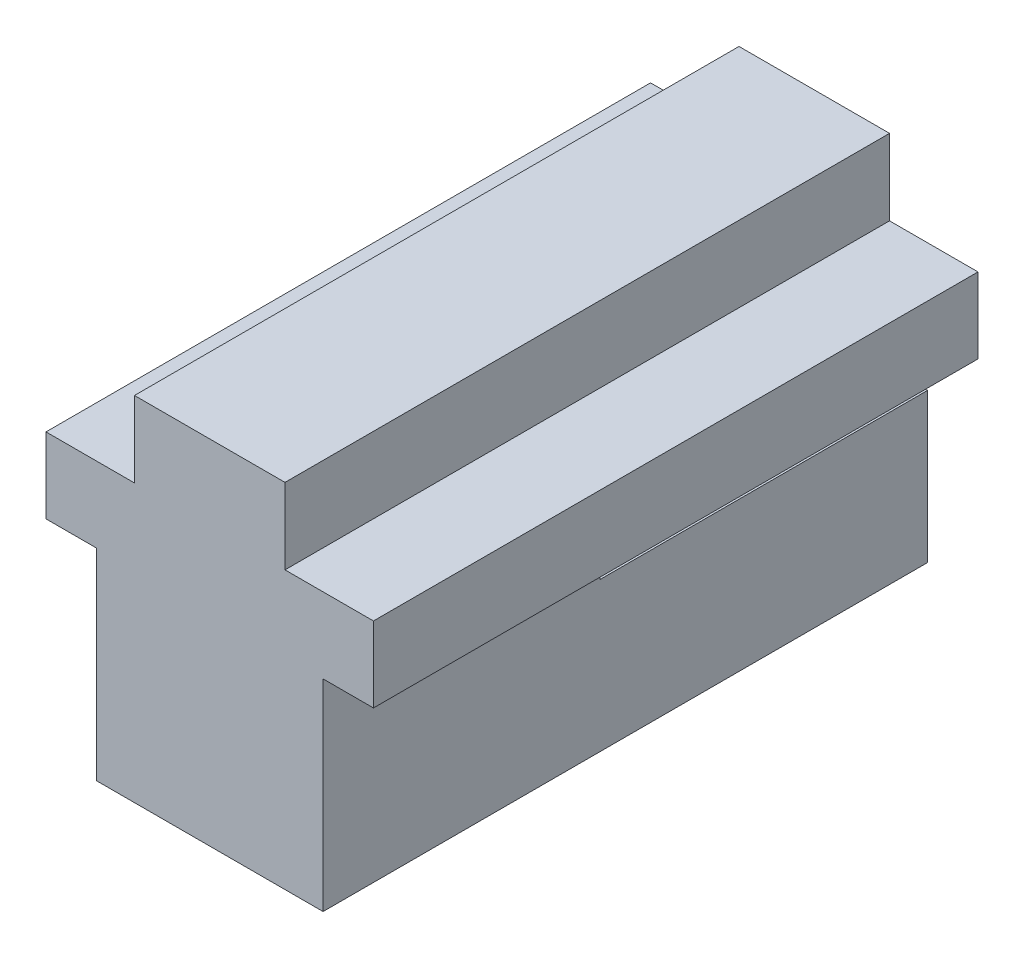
ISO-10303-21;
HEADER;
FILE_DESCRIPTION(('STEP AP214'),'2;1');
FILE_NAME('part.step','',(''),(''),'','','');
FILE_SCHEMA(('AUTOMOTIVE_DESIGN { 1 0 10303 214 1 1 1 1 }'));
ENDSEC;
DATA;
#1=APPLICATION_CONTEXT('core data for automotive mechanical design processes');
#2=APPLICATION_PROTOCOL_DEFINITION('international standard','automotive_design',2000,#1);
#3=PRODUCT_CONTEXT('',#1,'mechanical');
#4=PRODUCT('Part','Part','',(#3));
#5=PRODUCT_RELATED_PRODUCT_CATEGORY('part','',(#4));
#6=PRODUCT_DEFINITION_FORMATION('','',#4);
#7=PRODUCT_DEFINITION_CONTEXT('part definition',#1,'design');
#8=PRODUCT_DEFINITION('design','',#6,#7);
#9=PRODUCT_DEFINITION_SHAPE('','',#8);
#10=(LENGTH_UNIT() NAMED_UNIT(*) SI_UNIT(.MILLI.,.METRE.));
#11=(NAMED_UNIT(*) PLANE_ANGLE_UNIT() SI_UNIT($,.RADIAN.));
#12=(NAMED_UNIT(*) SI_UNIT($,.STERADIAN.) SOLID_ANGLE_UNIT());
#13=UNCERTAINTY_MEASURE_WITH_UNIT(LENGTH_MEASURE(1.E-05),#10,'distance_accuracy_value','');
#14=(GEOMETRIC_REPRESENTATION_CONTEXT(3) GLOBAL_UNCERTAINTY_ASSIGNED_CONTEXT((#13)) GLOBAL_UNIT_ASSIGNED_CONTEXT((#10,
#11,#12)) REPRESENTATION_CONTEXT('',''));
#15=CARTESIAN_POINT('',(0.,0.,0.));
#16=DIRECTION('',(0.,0.,1.));
#17=DIRECTION('',(1.,0.,0.));
#18=AXIS2_PLACEMENT_3D('',#15,#16,#17);
#19=CARTESIAN_POINT('',(0.,0.,-76.2));
#20=DIRECTION('',(0.,0.,-1.));
#21=DIRECTION('',(-1.,0.,0.));
#22=AXIS2_PLACEMENT_3D('',#19,#20,#21);
#23=PLANE('',#22);
#24=DIRECTION('',(0.,1.,0.));
#25=VECTOR('',#24,1.);
#26=CARTESIAN_POINT('',(38.2651,-3.1496,-76.2));
#27=LINE('',#26,#25);
#28=CARTESIAN_POINT('',(38.2651,-3.1496,-76.2));
#29=VERTEX_POINT('',#28);
#30=CARTESIAN_POINT('',(38.2651,6.35,-76.2));
#31=VERTEX_POINT('',#30);
#32=EDGE_CURVE('E260',#29,#31,#27,.T.);
#33=ORIENTED_EDGE('',*,*,#32,.F.);
#34=DIRECTION('',(1.,0.,0.));
#35=VECTOR('',#34,1.);
#36=CARTESIAN_POINT('',(-3.00990000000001,-3.1496,-76.2));
#37=LINE('',#36,#35);
#38=CARTESIAN_POINT('',(-3.00990000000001,-3.1496,-76.2));
#39=VERTEX_POINT('',#38);
#40=EDGE_CURVE('E278',#39,#29,#37,.T.);
#41=ORIENTED_EDGE('',*,*,#40,.F.);
#42=DIRECTION('',(0.,-1.,0.));
#43=VECTOR('',#42,1.);
#44=CARTESIAN_POINT('',(-3.00990000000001,-3.1496,-76.2));
#45=LINE('',#44,#43);
#46=CARTESIAN_POINT('',(-3.00990000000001,6.35,-76.2));
#47=VERTEX_POINT('',#46);
#48=EDGE_CURVE('E196',#47,#39,#45,.T.);
#49=ORIENTED_EDGE('',*,*,#48,.F.);
#50=DIRECTION('',(-1.,0.,0.));
#51=VECTOR('',#50,1.);
#52=CARTESIAN_POINT('',(-3.00990000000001,6.35,-76.2));
#53=LINE('',#52,#51);
#54=CARTESIAN_POINT('',(8.14069999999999,6.35,-76.2));
#55=VERTEX_POINT('',#54);
#56=EDGE_CURVE('E152',#55,#47,#53,.T.);
#57=ORIENTED_EDGE('',*,*,#56,.F.);
#58=DIRECTION('',(0.,-1.,0.));
#59=VECTOR('',#58,1.);
#60=CARTESIAN_POINT('',(8.14069999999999,6.35,-76.2));
#61=LINE('',#60,#59);
#62=CARTESIAN_POINT('',(8.14069999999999,15.9004,-76.2));
#63=VERTEX_POINT('',#62);
#64=EDGE_CURVE('E135',#63,#55,#61,.T.);
#65=ORIENTED_EDGE('',*,*,#64,.F.);
#66=DIRECTION('',(-1.,0.,0.));
#67=VECTOR('',#66,1.);
#68=CARTESIAN_POINT('',(8.14069999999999,15.9004,-76.2));
#69=LINE('',#68,#67);
#70=CARTESIAN_POINT('',(27.1145,15.9004,-76.2));
#71=VERTEX_POINT('',#70);
#72=EDGE_CURVE('E150',#71,#63,#69,.T.);
#73=ORIENTED_EDGE('',*,*,#72,.F.);
#74=DIRECTION('',(0.,1.,0.));
#75=VECTOR('',#74,1.);
#76=CARTESIAN_POINT('',(27.1145,6.35,-76.2));
#77=LINE('',#76,#75);
#78=CARTESIAN_POINT('',(27.1145,6.35,-76.2));
#79=VERTEX_POINT('',#78);
#80=EDGE_CURVE('E155',#79,#71,#77,.T.);
#81=ORIENTED_EDGE('',*,*,#80,.F.);
#82=DIRECTION('',(-1.,0.,0.));
#83=VECTOR('',#82,1.);
#84=CARTESIAN_POINT('',(27.1145,6.35,-76.2));
#85=LINE('',#84,#83);
#86=EDGE_CURVE('E157',#31,#79,#85,.T.);
#87=ORIENTED_EDGE('',*,*,#86,.F.);
#88=EDGE_LOOP('',(#33,#41,#49,#57,#65,#73,#81,#87));
#89=FACE_BOUND('',#88,.T.);
#90=ADVANCED_FACE('F35',(#89),#23,.T.);
#91=CARTESIAN_POINT('',(-3.00990000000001,-3.1496,-76.2));
#92=DIRECTION('',(-1.,0.,0.));
#93=DIRECTION('',(0.,0.,1.));
#94=AXIS2_PLACEMENT_3D('',#91,#92,#93);
#95=PLANE('',#94);
#96=DIRECTION('',(0.,-1.,0.));
#97=VECTOR('',#96,1.);
#98=CARTESIAN_POINT('',(-3.00990000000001,-3.1496,0.));
#99=LINE('',#98,#97);
#100=CARTESIAN_POINT('',(-3.00990000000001,6.35,0.));
#101=VERTEX_POINT('',#100);
#102=CARTESIAN_POINT('',(-3.00990000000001,-3.1496,0.));
#103=VERTEX_POINT('',#102);
#104=EDGE_CURVE('E162',#101,#103,#99,.T.);
#105=ORIENTED_EDGE('',*,*,#104,.F.);
#106=DIRECTION('',(0.,0.,1.));
#107=VECTOR('',#106,1.);
#108=CARTESIAN_POINT('',(-3.00990000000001,6.35,-76.2));
#109=LINE('',#108,#107);
#110=EDGE_CURVE('E43',#47,#101,#109,.T.);
#111=ORIENTED_EDGE('',*,*,#110,.F.);
#112=ORIENTED_EDGE('',*,*,#48,.T.);
#113=DIRECTION('',(0.,0.,1.));
#114=VECTOR('',#113,1.);
#115=CARTESIAN_POINT('',(-3.00990000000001,-3.1496,-76.2));
#116=LINE('',#115,#114);
#117=EDGE_CURVE('E108',#39,#103,#116,.T.);
#118=ORIENTED_EDGE('',*,*,#117,.T.);
#119=EDGE_LOOP('',(#105,#111,#112,#118));
#120=FACE_BOUND('',#119,.T.);
#121=ADVANCED_FACE('F37',(#120),#95,.T.);
#122=CARTESIAN_POINT('',(-3.00990000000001,6.35,-76.2));
#123=DIRECTION('',(0.,1.,0.));
#124=DIRECTION('',(0.,0.,1.));
#125=AXIS2_PLACEMENT_3D('',#122,#123,#124);
#126=PLANE('',#125);
#127=DIRECTION('',(-1.,0.,0.));
#128=VECTOR('',#127,1.);
#129=CARTESIAN_POINT('',(-3.00990000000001,6.35,0.));
#130=LINE('',#129,#128);
#131=CARTESIAN_POINT('',(8.14069999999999,6.35,0.));
#132=VERTEX_POINT('',#131);
#133=EDGE_CURVE('E193',#132,#101,#130,.T.);
#134=ORIENTED_EDGE('',*,*,#133,.F.);
#135=DIRECTION('',(0.,0.,1.));
#136=VECTOR('',#135,1.);
#137=CARTESIAN_POINT('',(8.14069999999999,6.35,-76.2));
#138=LINE('',#137,#136);
#139=EDGE_CURVE('E143',#55,#132,#138,.T.);
#140=ORIENTED_EDGE('',*,*,#139,.F.);
#141=ORIENTED_EDGE('',*,*,#56,.T.);
#142=ORIENTED_EDGE('',*,*,#110,.T.);
#143=EDGE_LOOP('',(#134,#140,#141,#142));
#144=FACE_BOUND('',#143,.T.);
#145=ADVANCED_FACE('F220',(#144),#126,.T.);
#146=CARTESIAN_POINT('',(8.14069999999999,6.35,-76.2));
#147=DIRECTION('',(-1.,0.,0.));
#148=DIRECTION('',(0.,0.,1.));
#149=AXIS2_PLACEMENT_3D('',#146,#147,#148);
#150=PLANE('',#149);
#151=DIRECTION('',(0.,-1.,0.));
#152=VECTOR('',#151,1.);
#153=CARTESIAN_POINT('',(8.14069999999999,6.35,0.));
#154=LINE('',#153,#152);
#155=CARTESIAN_POINT('',(8.14069999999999,15.9004,0.));
#156=VERTEX_POINT('',#155);
#157=EDGE_CURVE('E138',#156,#132,#154,.T.);
#158=ORIENTED_EDGE('',*,*,#157,.F.);
#159=DIRECTION('',(0.,0.,1.));
#160=VECTOR('',#159,1.);
#161=CARTESIAN_POINT('',(8.14069999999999,15.9004,-76.2));
#162=LINE('',#161,#160);
#163=EDGE_CURVE('E132',#63,#156,#162,.T.);
#164=ORIENTED_EDGE('',*,*,#163,.F.);
#165=ORIENTED_EDGE('',*,*,#64,.T.);
#166=ORIENTED_EDGE('',*,*,#139,.T.);
#167=EDGE_LOOP('',(#158,#164,#165,#166));
#168=FACE_BOUND('',#167,.T.);
#169=ADVANCED_FACE('F134',(#168),#150,.T.);
#170=CARTESIAN_POINT('',(8.14069999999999,15.9004,-76.2));
#171=DIRECTION('',(0.,1.,0.));
#172=DIRECTION('',(0.,0.,1.));
#173=AXIS2_PLACEMENT_3D('',#170,#171,#172);
#174=PLANE('',#173);
#175=DIRECTION('',(-1.,0.,0.));
#176=VECTOR('',#175,1.);
#177=CARTESIAN_POINT('',(8.14069999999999,15.9004,0.));
#178=LINE('',#177,#176);
#179=CARTESIAN_POINT('',(27.1145,15.9004,0.));
#180=VERTEX_POINT('',#179);
#181=EDGE_CURVE('E190',#180,#156,#178,.T.);
#182=ORIENTED_EDGE('',*,*,#181,.F.);
#183=DIRECTION('',(0.,0.,1.));
#184=VECTOR('',#183,1.);
#185=CARTESIAN_POINT('',(27.1145,15.9004,-76.2));
#186=LINE('',#185,#184);
#187=EDGE_CURVE('E144',#71,#180,#186,.T.);
#188=ORIENTED_EDGE('',*,*,#187,.F.);
#189=ORIENTED_EDGE('',*,*,#72,.T.);
#190=ORIENTED_EDGE('',*,*,#163,.T.);
#191=EDGE_LOOP('',(#182,#188,#189,#190));
#192=FACE_BOUND('',#191,.T.);
#193=ADVANCED_FACE('F154',(#192),#174,.T.);
#194=CARTESIAN_POINT('',(27.1145,6.35,-76.2));
#195=DIRECTION('',(1.,0.,0.));
#196=DIRECTION('',(0.,1.,0.));
#197=AXIS2_PLACEMENT_3D('',#194,#195,#196);
#198=PLANE('',#197);
#199=DIRECTION('',(0.,1.,0.));
#200=VECTOR('',#199,1.);
#201=CARTESIAN_POINT('',(27.1145,6.35,0.));
#202=LINE('',#201,#200);
#203=CARTESIAN_POINT('',(27.1145,6.35,0.));
#204=VERTEX_POINT('',#203);
#205=EDGE_CURVE('E187',#204,#180,#202,.T.);
#206=ORIENTED_EDGE('',*,*,#205,.F.);
#207=DIRECTION('',(0.,0.,1.));
#208=VECTOR('',#207,1.);
#209=CARTESIAN_POINT('',(27.1145,6.35,-76.2));
#210=LINE('',#209,#208);
#211=EDGE_CURVE('E200',#79,#204,#210,.T.);
#212=ORIENTED_EDGE('',*,*,#211,.F.);
#213=ORIENTED_EDGE('',*,*,#80,.T.);
#214=ORIENTED_EDGE('',*,*,#187,.T.);
#215=EDGE_LOOP('',(#206,#212,#213,#214));
#216=FACE_BOUND('',#215,.T.);
#217=ADVANCED_FACE('F534',(#216),#198,.T.);
#218=CARTESIAN_POINT('',(27.1145,6.35,-76.2));
#219=DIRECTION('',(0.,1.,0.));
#220=DIRECTION('',(0.,0.,1.));
#221=AXIS2_PLACEMENT_3D('',#218,#219,#220);
#222=PLANE('',#221);
#223=DIRECTION('',(-1.,0.,0.));
#224=VECTOR('',#223,1.);
#225=CARTESIAN_POINT('',(27.1145,6.35,0.));
#226=LINE('',#225,#224);
#227=CARTESIAN_POINT('',(38.2651,6.35,0.));
#228=VERTEX_POINT('',#227);
#229=EDGE_CURVE('E184',#228,#204,#226,.T.);
#230=ORIENTED_EDGE('',*,*,#229,.F.);
#231=DIRECTION('',(0.,0.,1.));
#232=VECTOR('',#231,1.);
#233=CARTESIAN_POINT('',(38.2651,6.35,-76.2));
#234=LINE('',#233,#232);
#235=EDGE_CURVE('E202',#31,#228,#234,.T.);
#236=ORIENTED_EDGE('',*,*,#235,.F.);
#237=ORIENTED_EDGE('',*,*,#86,.T.);
#238=ORIENTED_EDGE('',*,*,#211,.T.);
#239=EDGE_LOOP('',(#230,#236,#237,#238));
#240=FACE_BOUND('',#239,.T.);
#241=ADVANCED_FACE('F271',(#240),#222,.T.);
#242=CARTESIAN_POINT('',(38.2651,-3.1496,-76.2));
#243=DIRECTION('',(1.,0.,0.));
#244=DIRECTION('',(0.,0.,-1.));
#245=AXIS2_PLACEMENT_3D('',#242,#243,#244);
#246=PLANE('',#245);
#247=DIRECTION('',(0.,1.,0.));
#248=VECTOR('',#247,1.);
#249=CARTESIAN_POINT('',(38.2651,-3.1496,0.));
#250=LINE('',#249,#248);
#251=CARTESIAN_POINT('',(38.2651,-3.1496,0.));
#252=VERTEX_POINT('',#251);
#253=EDGE_CURVE('E181',#252,#228,#250,.T.);
#254=ORIENTED_EDGE('',*,*,#253,.F.);
#255=DIRECTION('',(0.,0.,1.));
#256=VECTOR('',#255,1.);
#257=CARTESIAN_POINT('',(38.2651,-3.1496,-76.2));
#258=LINE('',#257,#256);
#259=EDGE_CURVE('E204',#29,#252,#258,.T.);
#260=ORIENTED_EDGE('',*,*,#259,.F.);
#261=ORIENTED_EDGE('',*,*,#32,.T.);
#262=ORIENTED_EDGE('',*,*,#235,.T.);
#263=EDGE_LOOP('',(#254,#260,#261,#262));
#264=FACE_BOUND('',#263,.T.);
#265=ADVANCED_FACE('F276',(#264),#246,.T.);
#266=CARTESIAN_POINT('',(31.9151,-3.1496,-76.2));
#267=DIRECTION('',(0.,-1.,0.));
#268=DIRECTION('',(1.,0.,0.));
#269=AXIS2_PLACEMENT_3D('',#266,#267,#268);
#270=PLANE('',#269);
#271=DIRECTION('',(0.,0.,1.));
#272=VECTOR('',#271,1.);
#273=CARTESIAN_POINT('',(31.9151,-3.1496,-76.2));
#274=LINE('',#273,#272);
#275=CARTESIAN_POINT('',(31.9151,-3.14959999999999,-34.925));
#276=VERTEX_POINT('',#275);
#277=CARTESIAN_POINT('',(31.9151,-3.1496,0.));
#278=VERTEX_POINT('',#277);
#279=EDGE_CURVE('E206',#276,#278,#274,.T.);
#280=ORIENTED_EDGE('',*,*,#279,.F.);
#281=DIRECTION('',(-1.,0.,0.));
#282=VECTOR('',#281,1.);
#283=CARTESIAN_POINT('',(38.2651,-3.14959999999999,-34.925));
#284=LINE('',#283,#282);
#285=CARTESIAN_POINT('',(3.3401,-3.1496,-34.925));
#286=VERTEX_POINT('',#285);
#287=EDGE_CURVE('E320',#276,#286,#284,.T.);
#288=ORIENTED_EDGE('',*,*,#287,.T.);
#289=DIRECTION('',(0.,0.,1.));
#290=VECTOR('',#289,1.);
#291=CARTESIAN_POINT('',(3.3401,-3.1496,-76.2));
#292=LINE('',#291,#290);
#293=CARTESIAN_POINT('',(3.3401,-3.1496,0.));
#294=VERTEX_POINT('',#293);
#295=EDGE_CURVE('E212',#286,#294,#292,.T.);
#296=ORIENTED_EDGE('',*,*,#295,.T.);
#297=DIRECTION('',(1.,0.,0.));
#298=VECTOR('',#297,1.);
#299=CARTESIAN_POINT('',(-3.00990000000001,-3.1496,0.));
#300=LINE('',#299,#298);
#301=EDGE_CURVE('E165',#103,#294,#300,.T.);
#302=ORIENTED_EDGE('',*,*,#301,.F.);
#303=ORIENTED_EDGE('',*,*,#117,.F.);
#304=ORIENTED_EDGE('',*,*,#40,.T.);
#305=ORIENTED_EDGE('',*,*,#259,.T.);
#306=DIRECTION('',(1.,0.,0.));
#307=VECTOR('',#306,1.);
#308=CARTESIAN_POINT('',(31.9151,-3.1496,0.));
#309=LINE('',#308,#307);
#310=EDGE_CURVE('E178',#278,#252,#309,.T.);
#311=ORIENTED_EDGE('',*,*,#310,.F.);
#312=EDGE_LOOP('',(#280,#288,#296,#302,#303,#304,#305,#311));
#313=FACE_BOUND('',#312,.T.);
#314=ADVANCED_FACE('F214',(#313),#270,.T.);
#315=CARTESIAN_POINT('',(31.9151,-3.1496,-76.2));
#316=DIRECTION('',(1.,0.,0.));
#317=DIRECTION('',(0.,0.,-1.));
#318=AXIS2_PLACEMENT_3D('',#315,#316,#317);
#319=PLANE('',#318);
#320=DIRECTION('',(0.,-1.,0.));
#321=VECTOR('',#320,1.);
#322=CARTESIAN_POINT('',(31.9151,-3.1496,-34.925));
#323=LINE('',#322,#321);
#324=CARTESIAN_POINT('',(31.9151,-9.75359999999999,-34.925));
#325=VERTEX_POINT('',#324);
#326=EDGE_CURVE('E311',#276,#325,#323,.T.);
#327=ORIENTED_EDGE('',*,*,#326,.F.);
#328=ORIENTED_EDGE('',*,*,#279,.T.);
#329=DIRECTION('',(0.,1.,0.));
#330=VECTOR('',#329,1.);
#331=CARTESIAN_POINT('',(31.9151,-3.1496,0.));
#332=LINE('',#331,#330);
#333=CARTESIAN_POINT('',(31.9151,-28.5496,0.));
#334=VERTEX_POINT('',#333);
#335=EDGE_CURVE('E175',#334,#278,#332,.T.);
#336=ORIENTED_EDGE('',*,*,#335,.F.);
#337=DIRECTION('',(0.,0.,1.));
#338=VECTOR('',#337,1.);
#339=CARTESIAN_POINT('',(31.9151,-28.5496,-76.2));
#340=LINE('',#339,#338);
#341=CARTESIAN_POINT('',(31.9151,-28.5496,-76.2));
#342=VERTEX_POINT('',#341);
#343=EDGE_CURVE('E208',#342,#334,#340,.T.);
#344=ORIENTED_EDGE('',*,*,#343,.F.);
#345=DIRECTION('',(0.,1.,0.));
#346=VECTOR('',#345,1.);
#347=CARTESIAN_POINT('',(31.9151,-3.1496,-76.2));
#348=LINE('',#347,#346);
#349=CARTESIAN_POINT('',(31.9151,-9.75359999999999,-76.2));
#350=VERTEX_POINT('',#349);
#351=EDGE_CURVE('E249',#342,#350,#348,.T.);
#352=ORIENTED_EDGE('',*,*,#351,.T.);
#353=DIRECTION('',(0.,0.,-1.));
#354=VECTOR('',#353,1.);
#355=CARTESIAN_POINT('',(31.9151,-9.75359999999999,-76.2));
#356=LINE('',#355,#354);
#357=EDGE_CURVE('E49',#325,#350,#356,.T.);
#358=ORIENTED_EDGE('',*,*,#357,.F.);
#359=EDGE_LOOP('',(#327,#328,#336,#344,#352,#358));
#360=FACE_BOUND('',#359,.T.);
#361=ADVANCED_FACE('F257',(#360),#319,.T.);
#362=CARTESIAN_POINT('',(3.3401,-28.5496,-76.2));
#363=DIRECTION('',(0.,-1.,0.));
#364=DIRECTION('',(0.,0.,-1.));
#365=AXIS2_PLACEMENT_3D('',#362,#363,#364);
#366=PLANE('',#365);
#367=CARTESIAN_POINT('',(17.6276,-28.5496,-4.76250000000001));
#368=DIRECTION('',(0.,-1.,0.));
#369=DIRECTION('',(0.,0.,-1.));
#370=AXIS2_PLACEMENT_3D('',#367,#368,#369);
#371=CIRCLE('',#370,3.048);
#372=CARTESIAN_POINT('',(17.6276,-28.5496,-7.8105));
#373=VERTEX_POINT('',#372);
#374=EDGE_CURVE('E308',#373,#373,#371,.T.);
#375=ORIENTED_EDGE('',*,*,#374,.F.);
#376=EDGE_LOOP('',(#375));
#377=FACE_BOUND('',#376,.T.);
#378=CARTESIAN_POINT('',(17.6276,-28.5496,-30.1625));
#379=DIRECTION('',(0.,-1.,0.));
#380=DIRECTION('',(0.,0.,-1.));
#381=AXIS2_PLACEMENT_3D('',#378,#379,#380);
#382=CIRCLE('',#381,3.048);
#383=CARTESIAN_POINT('',(17.6276,-28.5496,-33.2105));
#384=VERTEX_POINT('',#383);
#385=EDGE_CURVE('E299',#384,#384,#382,.T.);
#386=ORIENTED_EDGE('',*,*,#385,.F.);
#387=EDGE_LOOP('',(#386));
#388=FACE_BOUND('',#387,.T.);
#389=CARTESIAN_POINT('',(27.1526,-28.5496,-17.4625));
#390=DIRECTION('',(0.,-1.,0.));
#391=DIRECTION('',(1.,0.,0.));
#392=AXIS2_PLACEMENT_3D('',#389,#390,#391);
#393=CIRCLE('',#392,2.3876);
#394=CARTESIAN_POINT('',(29.5402,-28.5496,-17.4625));
#395=VERTEX_POINT('',#394);
#396=EDGE_CURVE('E288',#395,#395,#393,.T.);
#397=ORIENTED_EDGE('',*,*,#396,.F.);
#398=EDGE_LOOP('',(#397));
#399=FACE_BOUND('',#398,.T.);
#400=CARTESIAN_POINT('',(8.1026,-28.5496,-17.4625));
#401=DIRECTION('',(0.,-1.,0.));
#402=DIRECTION('',(1.,0.,0.));
#403=AXIS2_PLACEMENT_3D('',#400,#401,#402);
#404=CIRCLE('',#403,2.3876);
#405=CARTESIAN_POINT('',(10.4902,-28.5496,-17.4625));
#406=VERTEX_POINT('',#405);
#407=EDGE_CURVE('E282',#406,#406,#404,.T.);
#408=ORIENTED_EDGE('',*,*,#407,.F.);
#409=EDGE_LOOP('',(#408));
#410=FACE_BOUND('',#409,.T.);
#411=DIRECTION('',(1.,0.,0.));
#412=VECTOR('',#411,1.);
#413=CARTESIAN_POINT('',(3.3401,-28.5496,0.));
#414=LINE('',#413,#412);
#415=CARTESIAN_POINT('',(3.3401,-28.5496,0.));
#416=VERTEX_POINT('',#415);
#417=EDGE_CURVE('E172',#416,#334,#414,.T.);
#418=ORIENTED_EDGE('',*,*,#417,.F.);
#419=DIRECTION('',(0.,0.,1.));
#420=VECTOR('',#419,1.);
#421=CARTESIAN_POINT('',(3.3401,-28.5496,-76.2));
#422=LINE('',#421,#420);
#423=CARTESIAN_POINT('',(3.3401,-28.5496,-76.2));
#424=VERTEX_POINT('',#423);
#425=EDGE_CURVE('E210',#424,#416,#422,.T.);
#426=ORIENTED_EDGE('',*,*,#425,.F.);
#427=DIRECTION('',(1.,0.,0.));
#428=VECTOR('',#427,1.);
#429=CARTESIAN_POINT('',(3.3401,-28.5496,-76.2));
#430=LINE('',#429,#428);
#431=EDGE_CURVE('E261',#424,#342,#430,.T.);
#432=ORIENTED_EDGE('',*,*,#431,.T.);
#433=ORIENTED_EDGE('',*,*,#343,.T.);
#434=EDGE_LOOP('',(#418,#426,#432,#433));
#435=FACE_BOUND('',#434,.T.);
#436=ADVANCED_FACE('F243',(#377,#388,#399,#410,#435),#366,.T.);
#437=CARTESIAN_POINT('',(3.3401,-3.1496,-76.2));
#438=DIRECTION('',(-1.,0.,0.));
#439=DIRECTION('',(0.,-1.,0.));
#440=AXIS2_PLACEMENT_3D('',#437,#438,#439);
#441=PLANE('',#440);
#442=DIRECTION('',(0.,1.,0.));
#443=VECTOR('',#442,1.);
#444=CARTESIAN_POINT('',(3.3401,-3.1496,-34.925));
#445=LINE('',#444,#443);
#446=CARTESIAN_POINT('',(3.3401,-9.75359999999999,-34.925));
#447=VERTEX_POINT('',#446);
#448=EDGE_CURVE('E314',#447,#286,#445,.T.);
#449=ORIENTED_EDGE('',*,*,#448,.F.);
#450=DIRECTION('',(0.,0.,1.));
#451=VECTOR('',#450,1.);
#452=CARTESIAN_POINT('',(3.3401,-9.75359999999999,-76.2));
#453=LINE('',#452,#451);
#454=CARTESIAN_POINT('',(3.3401,-9.75359999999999,-76.2));
#455=VERTEX_POINT('',#454);
#456=EDGE_CURVE('E318',#455,#447,#453,.T.);
#457=ORIENTED_EDGE('',*,*,#456,.F.);
#458=DIRECTION('',(0.,-1.,0.));
#459=VECTOR('',#458,1.);
#460=CARTESIAN_POINT('',(3.3401,-3.1496,-76.2));
#461=LINE('',#460,#459);
#462=EDGE_CURVE('E252',#455,#424,#461,.T.);
#463=ORIENTED_EDGE('',*,*,#462,.T.);
#464=ORIENTED_EDGE('',*,*,#425,.T.);
#465=DIRECTION('',(0.,-1.,0.));
#466=VECTOR('',#465,1.);
#467=CARTESIAN_POINT('',(3.3401,-3.1496,0.));
#468=LINE('',#467,#466);
#469=EDGE_CURVE('E169',#294,#416,#468,.T.);
#470=ORIENTED_EDGE('',*,*,#469,.F.);
#471=ORIENTED_EDGE('',*,*,#295,.F.);
#472=EDGE_LOOP('',(#449,#457,#463,#464,#470,#471));
#473=FACE_BOUND('',#472,.T.);
#474=ADVANCED_FACE('F236',(#473),#441,.T.);
#475=DIRECTION('',(-1.,0.,0.));
#476=VECTOR('',#475,1.);
#477=CARTESIAN_POINT('',(0.,-9.75359999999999,-76.2));
#478=LINE('',#477,#476);
#479=EDGE_CURVE('E11',#350,#455,#478,.T.);
#480=ORIENTED_EDGE('',*,*,#479,.F.);
#481=ORIENTED_EDGE('',*,*,#351,.F.);
#482=ORIENTED_EDGE('',*,*,#431,.F.);
#483=ORIENTED_EDGE('',*,*,#462,.F.);
#484=EDGE_LOOP('',(#480,#481,#482,#483));
#485=FACE_BOUND('',#484,.T.);
#486=ADVANCED_FACE('F231',(#485),#23,.T.);
#487=CARTESIAN_POINT('',(0.,0.,0.));
#488=DIRECTION('',(0.,0.,-1.));
#489=DIRECTION('',(-1.,0.,0.));
#490=AXIS2_PLACEMENT_3D('',#487,#488,#489);
#491=PLANE('',#490);
#492=ORIENTED_EDGE('',*,*,#104,.T.);
#493=ORIENTED_EDGE('',*,*,#301,.T.);
#494=ORIENTED_EDGE('',*,*,#469,.T.);
#495=ORIENTED_EDGE('',*,*,#417,.T.);
#496=ORIENTED_EDGE('',*,*,#335,.T.);
#497=ORIENTED_EDGE('',*,*,#310,.T.);
#498=ORIENTED_EDGE('',*,*,#253,.T.);
#499=ORIENTED_EDGE('',*,*,#229,.T.);
#500=ORIENTED_EDGE('',*,*,#205,.T.);
#501=ORIENTED_EDGE('',*,*,#181,.T.);
#502=ORIENTED_EDGE('',*,*,#157,.T.);
#503=ORIENTED_EDGE('',*,*,#133,.T.);
#504=EDGE_LOOP('',(#492,#493,#494,#495,#496,#497,#498,#499,#500,#501,#502,#503));
#505=FACE_BOUND('',#504,.T.);
#506=ADVANCED_FACE('F219',(#505),#491,.F.);
#507=CARTESIAN_POINT('',(8.1026,-22.1996,-17.4625));
#508=DIRECTION('',(0.,-1.,0.));
#509=DIRECTION('',(1.,0.,0.));
#510=AXIS2_PLACEMENT_3D('',#507,#508,#509);
#511=CYLINDRICAL_SURFACE('',#510,2.3876);
#512=CARTESIAN_POINT('',(8.1026,-22.1996,-17.4625));
#513=DIRECTION('',(0.,-1.,0.));
#514=DIRECTION('',(1.,0.,0.));
#515=AXIS2_PLACEMENT_3D('',#512,#513,#514);
#516=CIRCLE('',#515,2.3876);
#517=CARTESIAN_POINT('',(10.4902,-22.1996,-17.4625));
#518=VERTEX_POINT('',#517);
#519=EDGE_CURVE('E166',#518,#518,#516,.T.);
#520=ORIENTED_EDGE('',*,*,#519,.F.);
#521=EDGE_LOOP('',(#520));
#522=FACE_BOUND('',#521,.T.);
#523=ORIENTED_EDGE('',*,*,#407,.T.);
#524=EDGE_LOOP('',(#523));
#525=FACE_BOUND('',#524,.T.);
#526=ADVANCED_FACE('F242',(#522,#525),#511,.F.);
#527=CARTESIAN_POINT('',(8.1026,-22.1996,-17.4625));
#528=DIRECTION('',(0.,-1.,0.));
#529=DIRECTION('',(1.,0.,0.));
#530=AXIS2_PLACEMENT_3D('',#527,#528,#529);
#531=PLANE('',#530);
#532=ORIENTED_EDGE('',*,*,#519,.T.);
#533=EDGE_LOOP('',(#532));
#534=FACE_BOUND('',#533,.T.);
#535=ADVANCED_FACE('F374',(#534),#531,.T.);
#536=CARTESIAN_POINT('',(27.1526,-22.1996,-17.4625));
#537=DIRECTION('',(0.,-1.,0.));
#538=DIRECTION('',(1.,0.,0.));
#539=AXIS2_PLACEMENT_3D('',#536,#537,#538);
#540=CYLINDRICAL_SURFACE('',#539,2.3876);
#541=CARTESIAN_POINT('',(27.1526,-22.1996,-17.4625));
#542=DIRECTION('',(0.,-1.,0.));
#543=DIRECTION('',(1.,0.,0.));
#544=AXIS2_PLACEMENT_3D('',#541,#542,#543);
#545=CIRCLE('',#544,2.3876);
#546=CARTESIAN_POINT('',(29.5402,-22.1996,-17.4625));
#547=VERTEX_POINT('',#546);
#548=EDGE_CURVE('E285',#547,#547,#545,.T.);
#549=ORIENTED_EDGE('',*,*,#548,.F.);
#550=EDGE_LOOP('',(#549));
#551=FACE_BOUND('',#550,.T.);
#552=ORIENTED_EDGE('',*,*,#396,.T.);
#553=EDGE_LOOP('',(#552));
#554=FACE_BOUND('',#553,.T.);
#555=ADVANCED_FACE('F379',(#551,#554),#540,.F.);
#556=CARTESIAN_POINT('',(27.1526,-22.1996,-17.4625));
#557=DIRECTION('',(0.,-1.,0.));
#558=DIRECTION('',(1.,0.,0.));
#559=AXIS2_PLACEMENT_3D('',#556,#557,#558);
#560=PLANE('',#559);
#561=ORIENTED_EDGE('',*,*,#548,.T.);
#562=EDGE_LOOP('',(#561));
#563=FACE_BOUND('',#562,.T.);
#564=ADVANCED_FACE('F349',(#563),#560,.T.);
#565=CARTESIAN_POINT('',(17.6276,-16.6116,-30.1625));
#566=DIRECTION('',(0.,-1.,0.));
#567=DIRECTION('',(0.,0.,-1.));
#568=AXIS2_PLACEMENT_3D('',#565,#566,#567);
#569=CONICAL_SURFACE('',#568,2.01929999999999,1.02974425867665);
#570=CARTESIAN_POINT('',(17.6276,-15.3982821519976,-30.1625));
#571=VERTEX_POINT('',#570);
#572=VERTEX_LOOP('',#571);
#573=FACE_BOUND('',#572,.T.);
#574=CARTESIAN_POINT('',(17.6276,-16.6116,-30.1625));
#575=DIRECTION('',(0.,-1.,0.));
#576=DIRECTION('',(0.,0.,-1.));
#577=AXIS2_PLACEMENT_3D('',#574,#575,#576);
#578=CIRCLE('',#577,2.01929999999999);
#579=CARTESIAN_POINT('',(17.6276,-16.6116,-32.1818));
#580=VERTEX_POINT('',#579);
#581=EDGE_CURVE('E291',#580,#580,#578,.T.);
#582=ORIENTED_EDGE('',*,*,#581,.T.);
#583=EDGE_LOOP('',(#582));
#584=FACE_BOUND('',#583,.T.);
#585=ADVANCED_FACE('F345',(#573,#584),#569,.F.);
#586=CARTESIAN_POINT('',(17.6276,-28.5496,-30.1625));
#587=DIRECTION('',(0.,-1.,0.));
#588=DIRECTION('',(0.,0.,-1.));
#589=AXIS2_PLACEMENT_3D('',#586,#587,#588);
#590=CYLINDRICAL_SURFACE('',#589,2.0193);
#591=ORIENTED_EDGE('',*,*,#581,.F.);
#592=EDGE_LOOP('',(#591));
#593=FACE_BOUND('',#592,.T.);
#594=CARTESIAN_POINT('',(17.6276,-27.5209,-30.1625));
#595=DIRECTION('',(0.,-1.,0.));
#596=DIRECTION('',(0.,0.,-1.));
#597=AXIS2_PLACEMENT_3D('',#594,#595,#596);
#598=CIRCLE('',#597,2.0193);
#599=CARTESIAN_POINT('',(17.6276,-27.5209,-32.1818));
#600=VERTEX_POINT('',#599);
#601=EDGE_CURVE('E296',#600,#600,#598,.T.);
#602=ORIENTED_EDGE('',*,*,#601,.T.);
#603=EDGE_LOOP('',(#602));
#604=FACE_BOUND('',#603,.T.);
#605=ADVANCED_FACE('F348',(#593,#604),#590,.F.);
#606=CARTESIAN_POINT('',(17.6276,-28.5496,-30.1625));
#607=DIRECTION('',(0.,-1.,0.));
#608=DIRECTION('',(0.,0.,-1.));
#609=AXIS2_PLACEMENT_3D('',#606,#607,#608);
#610=CONICAL_SURFACE('',#609,3.048,0.785398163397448);
#611=ORIENTED_EDGE('',*,*,#601,.F.);
#612=EDGE_LOOP('',(#611));
#613=FACE_BOUND('',#612,.T.);
#614=ORIENTED_EDGE('',*,*,#385,.T.);
#615=EDGE_LOOP('',(#614));
#616=FACE_BOUND('',#615,.T.);
#617=ADVANCED_FACE('F355',(#613,#616),#610,.F.);
#618=CARTESIAN_POINT('',(17.6276,-16.6116,-4.76250000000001));
#619=DIRECTION('',(0.,-1.,0.));
#620=DIRECTION('',(0.,0.,-1.));
#621=AXIS2_PLACEMENT_3D('',#618,#619,#620);
#622=CONICAL_SURFACE('',#621,2.01929999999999,1.02974425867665);
#623=CARTESIAN_POINT('',(17.6276,-15.3982821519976,-4.76250000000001));
#624=VERTEX_POINT('',#623);
#625=VERTEX_LOOP('',#624);
#626=FACE_BOUND('',#625,.T.);
#627=CARTESIAN_POINT('',(17.6276,-16.6116,-4.76250000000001));
#628=DIRECTION('',(0.,-1.,0.));
#629=DIRECTION('',(0.,0.,-1.));
#630=AXIS2_PLACEMENT_3D('',#627,#628,#629);
#631=CIRCLE('',#630,2.01929999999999);
#632=CARTESIAN_POINT('',(17.6276,-16.6116,-6.7818));
#633=VERTEX_POINT('',#632);
#634=EDGE_CURVE('E302',#633,#633,#631,.T.);
#635=ORIENTED_EDGE('',*,*,#634,.T.);
#636=EDGE_LOOP('',(#635));
#637=FACE_BOUND('',#636,.T.);
#638=ADVANCED_FACE('F361',(#626,#637),#622,.F.);
#639=CARTESIAN_POINT('',(17.6276,-28.5496,-4.76250000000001));
#640=DIRECTION('',(0.,-1.,0.));
#641=DIRECTION('',(0.,0.,-1.));
#642=AXIS2_PLACEMENT_3D('',#639,#640,#641);
#643=CYLINDRICAL_SURFACE('',#642,2.0193);
#644=ORIENTED_EDGE('',*,*,#634,.F.);
#645=EDGE_LOOP('',(#644));
#646=FACE_BOUND('',#645,.T.);
#647=CARTESIAN_POINT('',(17.6276,-27.5209,-4.76250000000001));
#648=DIRECTION('',(0.,-1.,0.));
#649=DIRECTION('',(0.,0.,-1.));
#650=AXIS2_PLACEMENT_3D('',#647,#648,#649);
#651=CIRCLE('',#650,2.0193);
#652=CARTESIAN_POINT('',(17.6276,-27.5209,-6.7818));
#653=VERTEX_POINT('',#652);
#654=EDGE_CURVE('E305',#653,#653,#651,.T.);
#655=ORIENTED_EDGE('',*,*,#654,.T.);
#656=EDGE_LOOP('',(#655));
#657=FACE_BOUND('',#656,.T.);
#658=ADVANCED_FACE('F392',(#646,#657),#643,.F.);
#659=CARTESIAN_POINT('',(17.6276,-28.5496,-4.76250000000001));
#660=DIRECTION('',(0.,-1.,0.));
#661=DIRECTION('',(0.,0.,-1.));
#662=AXIS2_PLACEMENT_3D('',#659,#660,#661);
#663=CONICAL_SURFACE('',#662,3.048,0.785398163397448);
#664=ORIENTED_EDGE('',*,*,#654,.F.);
#665=EDGE_LOOP('',(#664));
#666=FACE_BOUND('',#665,.T.);
#667=ORIENTED_EDGE('',*,*,#374,.T.);
#668=EDGE_LOOP('',(#667));
#669=FACE_BOUND('',#668,.T.);
#670=ADVANCED_FACE('F395',(#666,#669),#663,.F.);
#671=CARTESIAN_POINT('',(38.2651,-3.14959999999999,-34.925));
#672=DIRECTION('',(0.,0.,1.));
#673=DIRECTION('',(1.,0.,0.));
#674=AXIS2_PLACEMENT_3D('',#671,#672,#673);
#675=PLANE('',#674);
#676=ORIENTED_EDGE('',*,*,#326,.T.);
#677=DIRECTION('',(-1.,0.,0.));
#678=VECTOR('',#677,1.);
#679=CARTESIAN_POINT('',(38.2651,-9.75359999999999,-34.925));
#680=LINE('',#679,#678);
#681=EDGE_CURVE('E321',#325,#447,#680,.T.);
#682=ORIENTED_EDGE('',*,*,#681,.T.);
#683=ORIENTED_EDGE('',*,*,#448,.T.);
#684=ORIENTED_EDGE('',*,*,#287,.F.);
#685=EDGE_LOOP('',(#676,#682,#683,#684));
#686=FACE_BOUND('',#685,.T.);
#687=ADVANCED_FACE('F336',(#686),#675,.F.);
#688=CARTESIAN_POINT('',(38.2651,-9.75359999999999,-76.2));
#689=DIRECTION('',(0.,-1.,0.));
#690=DIRECTION('',(1.,0.,0.));
#691=AXIS2_PLACEMENT_3D('',#688,#689,#690);
#692=PLANE('',#691);
#693=ORIENTED_EDGE('',*,*,#357,.T.);
#694=ORIENTED_EDGE('',*,*,#479,.T.);
#695=ORIENTED_EDGE('',*,*,#456,.T.);
#696=ORIENTED_EDGE('',*,*,#681,.F.);
#697=EDGE_LOOP('',(#693,#694,#695,#696));
#698=FACE_BOUND('',#697,.T.);
#699=ADVANCED_FACE('F338',(#698),#692,.F.);
#700=CLOSED_SHELL('',(#90,#121,#145,#169,#193,#217,#241,#265,#314,#361,#436,#474,#486,#506,#526,
#535,#555,#564,#585,#605,#617,#638,#658,#670,#687,#699));
#701=MANIFOLD_SOLID_BREP('B2',#700);
#702=ADVANCED_BREP_SHAPE_REPRESENTATION('',(#18,#701),#14);
#703=SHAPE_DEFINITION_REPRESENTATION(#9,#702);
ENDSEC;
END-ISO-10303-21;
